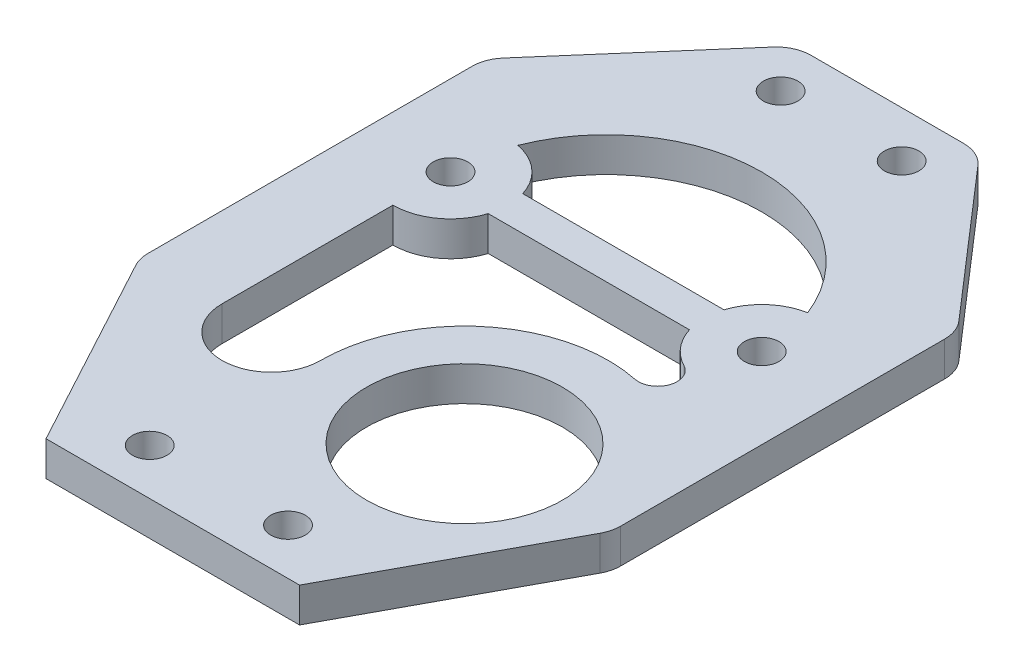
from build123d import *

# Parameters (mm, degrees)
CROQUIS1_R              = 8.5
CROQUIS1_R_2            = 1.5
SALIENTE_EXTRUIR1_DEPTH = 1.5
REDONDEO1_R             = 3


with BuildPart() as part:
    # Croquis1 → Saliente-Extruir1 (new, symmetric)
    with BuildSketch(Plane(origin=(0, 0, 0), x_dir=(1, 0, 0), z_dir=(0, 1, 0))):
        Polygon((-11, 0), (11, 0), (20.5, 17.599715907), (20.5, 47.599715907), (8, 62), (-8, 62), (-20.5, 47.599715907), (-20.5, 17.599715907), align=None)
        with Locations(Location((7.530163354, 17.782301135, 0), (0, 0, 270))):
            Circle(CROQUIS1_R, mode=Mode.SUBTRACT)
        with Locations(Location((-5.25, 57.994261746, 0), (0, 0, 270))):
            Circle(CROQUIS1_R_2, mode=Mode.SUBTRACT)
        with Locations(Location((-13.5, 37.599715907, 0), (0, 0, 270))):
            Circle(CROQUIS1_R_2, mode=Mode.SUBTRACT)
        with Locations(Location((13.5, 37.599715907, 0), (0, 0, 270))):
            Circle(CROQUIS1_R_2, mode=Mode.SUBTRACT)
        with Locations(Location((5.25, 57.994261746, 0), (0, 0, 270))):
            Circle(CROQUIS1_R_2, mode=Mode.SUBTRACT)
        with Locations(Location((-6, 4, 0), (0, 0, 270))):
            Circle(CROQUIS1_R_2, mode=Mode.SUBTRACT)
        with Locations(Location((6, 4, 0), (0, 0, 270))):
            Circle(CROQUIS1_R_2, mode=Mode.SUBTRACT)
        with BuildLine():
            Line((-8.730303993, 39.099715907), (8.730303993, 39.099715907))
            ThreePointArc((8.730303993, 39.099715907), (10.179901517, 41.338291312), (12.574074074, 42.513234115))
            ThreePointArc((12.574074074, 42.513234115), (0, 51.099715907), (-12.574074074, 42.513234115))
            ThreePointArc((-12.574074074, 42.513234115), (-10.179901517, 41.338291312), (-8.730303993, 39.099715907))
        make_face(mode=Mode.SUBTRACT)
        with BuildLine():
            Line((-13.5, 32.599715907), (-13.5, 17.782301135))
            ThreePointArc((-13.5, 17.782301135), (-9.234918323, 13.517219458), (-4.969836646, 17.782301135))
            ThreePointArc((-4.969836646, 17.782301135), (-0.361028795, 27.476582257), (10.06681719, 30.022210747))
            ThreePointArc((10.06681719, 30.022210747), (11.99598649, 31.106273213), (11.187975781, 33.166371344))
            ThreePointArc((11.187975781, 33.166371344), (9.667400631, 34.388612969), (8.730303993, 36.099715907))
            Line((8.730303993, 36.099715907), (-8.730303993, 36.099715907))
            ThreePointArc((-8.730303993, 36.099715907), (-10.541960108, 33.568587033), (-13.5, 32.599715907))
        make_face(mode=Mode.SUBTRACT)
    extrude(amount=SALIENTE_EXTRUIR1_DEPTH, both=True)

    # Redondeo1
    redondeo1_edges = [part.edges().sort_by_distance(p)[0] for p in [
        (-20.5, 0, -17.599715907),
        (-20.5, 0, -47.599715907),
        (-8, 0, -62),
        (8, 0, -62),
        (20.5, 0, -47.599715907),
        (20.5, 0, -17.599715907),
    ]]
    fillet(redondeo1_edges, radius=REDONDEO1_R)


solid = part.part
